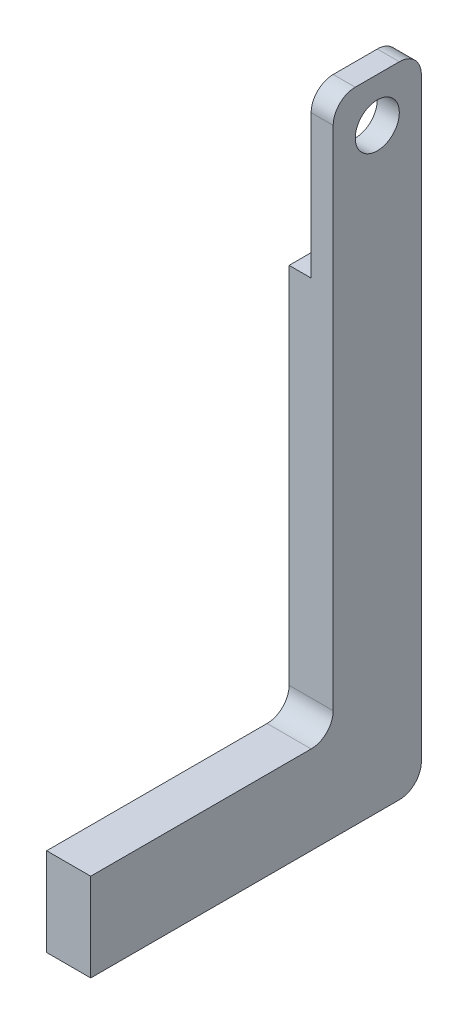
from build123d import *

# Parameters (mm, degrees)
SKETCH1_W           = 40
SKETCH1_H           = 250
BOSS_EXTRUDE1_DEPTH = 20
SKETCH2_W           = 40
SKETCH2_H           = 75
CUT_EXTRUDE1_DEPTH  = 10
FILLET1_R           = 10
SKETCH3_R           = 10
CUT_EXTRUDE2_DEPTH  = 10
SKETCH5_W           = 20
SKETCH5_H           = 40
BOSS_EXTRUDE2_DEPTH = 150
FILLET2_R           = 10
FILLET3_R           = 10


with BuildPart() as part:
    # Sketch1 → Boss-Extrude1 (new body)
    with BuildSketch(Plane(origin=(0, 0, 0), x_dir=(0, 0, -1), z_dir=(1, 0, 0))):
        Rectangle(SKETCH1_W, SKETCH1_H)
    extrude(amount=BOSS_EXTRUDE1_DEPTH)

    # Sketch2 → Cut-Extrude1 (cut)
    with BuildSketch(Plane.ZY):
        with Locations((0, 87.5)):
            Rectangle(SKETCH2_W, SKETCH2_H)
    extrude(amount=-CUT_EXTRUDE1_DEPTH, mode=Mode.SUBTRACT)

    # Fillet1
    fillet1_edges = [part.edges().sort_by_distance(p)[0] for p in [
        (15, 125, 20),
        (15, 125, -20),
    ]]
    fillet(fillet1_edges, radius=FILLET1_R)

    # Sketch3 → Cut-Extrude2 (cut)
    with BuildSketch(Plane(origin=(20, 0, 0), x_dir=(0, 0, -1), z_dir=(1, 0, 0))):
        with Locations((0, 105)):
            Circle(SKETCH3_R)
    extrude(amount=-CUT_EXTRUDE2_DEPTH, mode=Mode.SUBTRACT)

    # Sketch5 → Boss-Extrude2 (add)
    with BuildSketch(Plane(origin=(0, 0, -20), x_dir=(-1, 0, 0), z_dir=(0, 0, -1))):
        with Locations((-10, -145)):
            Rectangle(SKETCH5_W, SKETCH5_H)
    extrude(amount=-BOSS_EXTRUDE2_DEPTH)

    # Fillet2
    fillet2_edges = [part.edges().sort_by_distance(p)[0] for p in [
        (10, -165, -20),
    ]]
    fillet(fillet2_edges, radius=FILLET2_R)

    # Fillet3
    fillet3_edges = [part.edges().sort_by_distance(p)[0] for p in [
        (10, -125, 20),
    ]]
    fillet(fillet3_edges, radius=FILLET3_R)


solid = part.part
